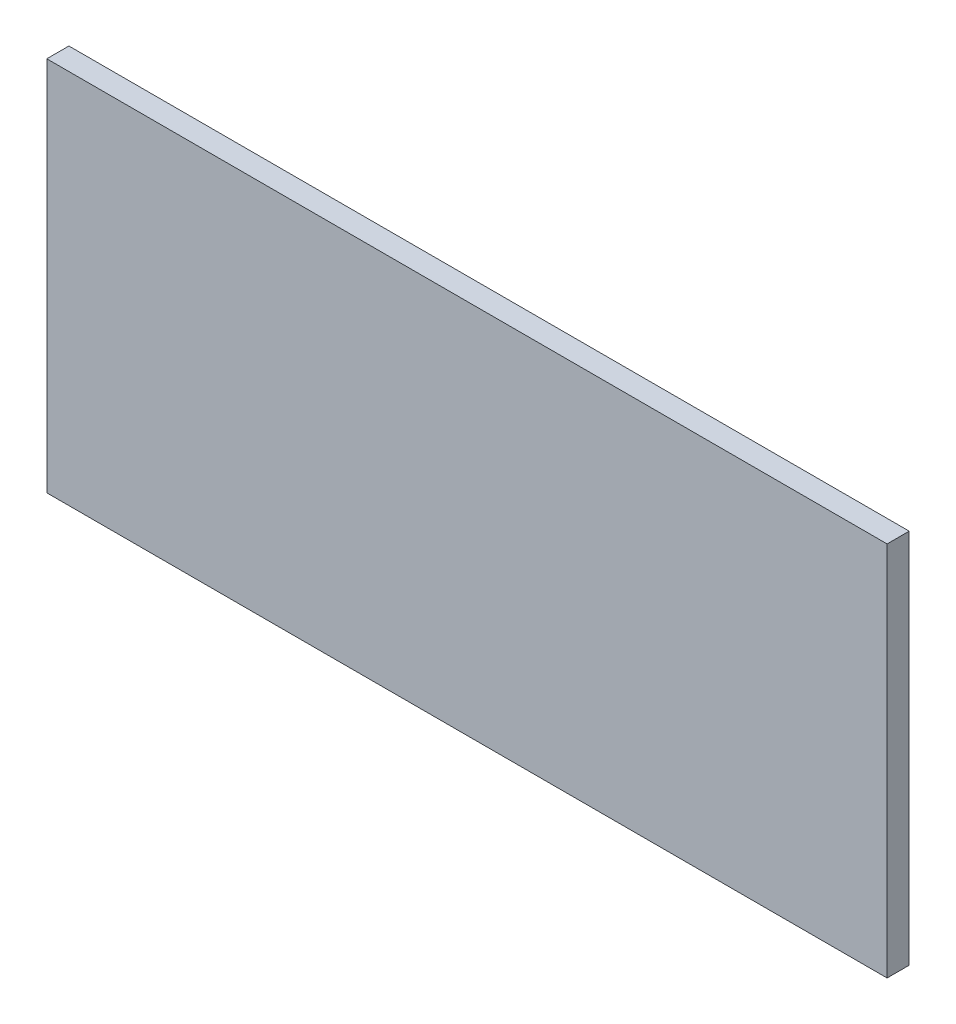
from build123d import *

# Parameters (mm, degrees)
SKETCH_1_W      = 190
SKETCH_1_H      = 85
EXTRUDE_1_DEPTH = 5
SKETCH_2_R      = 2.5
SKETCH_2_R_2    = 1.5
SKETCH_2_R_3    = 3
EXTRUDE_2_DEPTH = 10


with BuildPart() as part:
    # Sketch 1 → Extrude 1 (new body)
    with BuildSketch(Plane.XY):
        Rectangle(SKETCH_1_W, SKETCH_1_H)
    extrude(amount=EXTRUDE_1_DEPTH)

    # Sketch 2 → Extrude 2 (add)
    # profile 1 of 4: a face of its own
    with BuildSketch(Plane.XY.offset(5)):
        with Locations((-45, 32.5)):
            Circle(SKETCH_2_R)
        with Locations((-45, 32.5)):
            Circle(SKETCH_2_R_2, mode=Mode.SUBTRACT)
    # profile 2 of 4: a face of its own
    with BuildSketch(Plane.XY.offset(5)):
        with Locations((30, 32.5)):
            Circle(SKETCH_2_R)
        with Locations((30, 32.5)):
            Circle(SKETCH_2_R_2, mode=Mode.SUBTRACT)
    # profile 3 of 4: a face of its own
    with BuildSketch(Plane.XY.offset(5)):
        with Locations((32, -15.5)):
            Circle(SKETCH_2_R_3)
        with Locations((32, -15.5)):
            Circle(SKETCH_2_R_2, mode=Mode.SUBTRACT)
    # profile 4 of 4: a face of its own
    with BuildSketch(Plane.XY.offset(5)):
        with Locations((-50.5, -15.5)):
            Circle(SKETCH_2_R_3)
        with Locations((-50.5, -15.5)):
            Circle(SKETCH_2_R_2, mode=Mode.SUBTRACT)
    extrude(amount=-EXTRUDE_2_DEPTH)


solid = part.part
